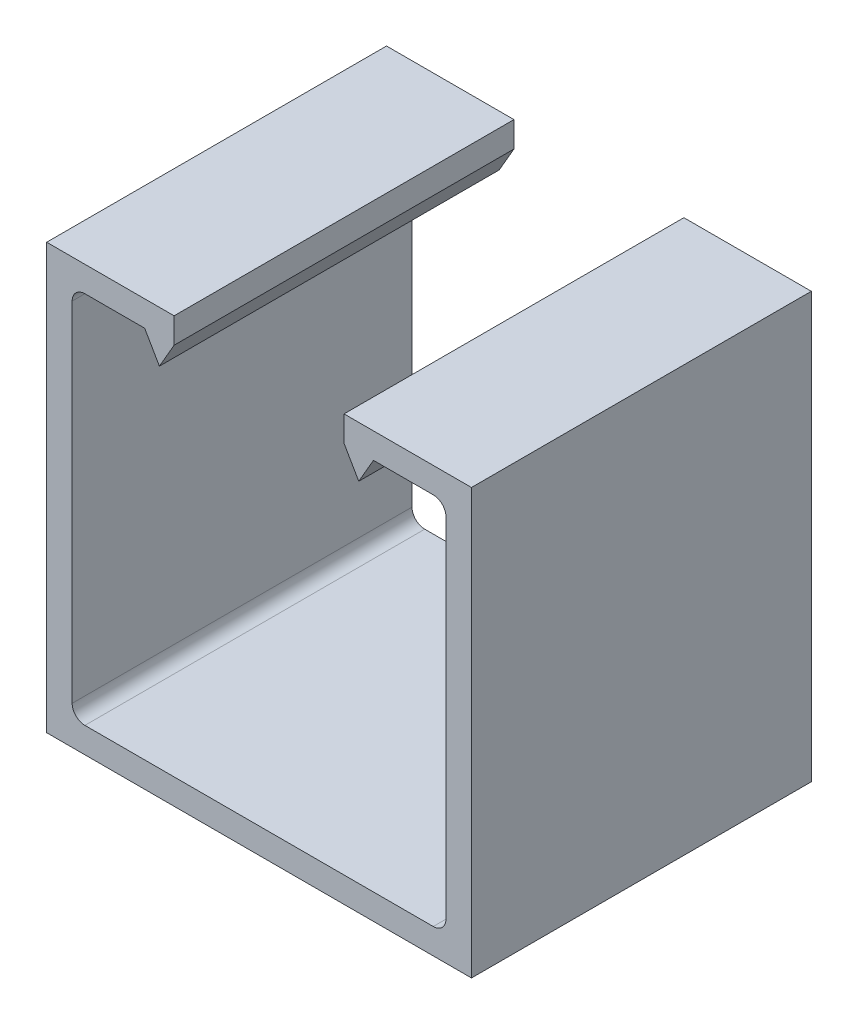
ISO-10303-21;
HEADER;
FILE_DESCRIPTION(('STEP AP214'),'2;1');
FILE_NAME('part.step','',(''),(''),'','','');
FILE_SCHEMA(('AUTOMOTIVE_DESIGN { 1 0 10303 214 1 1 1 1 }'));
ENDSEC;
DATA;
#1=APPLICATION_CONTEXT('core data for automotive mechanical design processes');
#2=APPLICATION_PROTOCOL_DEFINITION('international standard','automotive_design',2000,#1);
#3=PRODUCT_CONTEXT('',#1,'mechanical');
#4=PRODUCT('Part','Part','',(#3));
#5=PRODUCT_RELATED_PRODUCT_CATEGORY('part','',(#4));
#6=PRODUCT_DEFINITION_FORMATION('','',#4);
#7=PRODUCT_DEFINITION_CONTEXT('part definition',#1,'design');
#8=PRODUCT_DEFINITION('design','',#6,#7);
#9=PRODUCT_DEFINITION_SHAPE('','',#8);
#10=(LENGTH_UNIT() NAMED_UNIT(*) SI_UNIT(.MILLI.,.METRE.));
#11=(NAMED_UNIT(*) PLANE_ANGLE_UNIT() SI_UNIT($,.RADIAN.));
#12=(NAMED_UNIT(*) SI_UNIT($,.STERADIAN.) SOLID_ANGLE_UNIT());
#13=UNCERTAINTY_MEASURE_WITH_UNIT(LENGTH_MEASURE(1.E-05),#10,'distance_accuracy_value','');
#14=(GEOMETRIC_REPRESENTATION_CONTEXT(3) GLOBAL_UNCERTAINTY_ASSIGNED_CONTEXT((#13)) GLOBAL_UNIT_ASSIGNED_CONTEXT((#10,
#11,#12)) REPRESENTATION_CONTEXT('',''));
#15=CARTESIAN_POINT('',(0.,0.,0.));
#16=DIRECTION('',(0.,0.,1.));
#17=DIRECTION('',(1.,0.,0.));
#18=AXIS2_PLACEMENT_3D('',#15,#16,#17);
#19=CARTESIAN_POINT('',(-13.0175,-13.0175,12.7));
#20=DIRECTION('',(0.,0.,-1.));
#21=DIRECTION('',(-1.,0.,0.));
#22=AXIS2_PLACEMENT_3D('',#19,#20,#21);
#23=CYLINDRICAL_SURFACE('',#22,0.952500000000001);
#24=CARTESIAN_POINT('',(-13.0175,-13.0175,-12.7));
#25=DIRECTION('',(0.,0.,-1.));
#26=DIRECTION('',(1.,0.,0.));
#27=AXIS2_PLACEMENT_3D('',#24,#25,#26);
#28=CIRCLE('',#27,0.952500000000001);
#29=CARTESIAN_POINT('',(-13.0175,-13.97,-12.7));
#30=VERTEX_POINT('',#29);
#31=CARTESIAN_POINT('',(-13.97,-13.0175,-12.7));
#32=VERTEX_POINT('',#31);
#33=EDGE_CURVE('E200',#30,#32,#28,.T.);
#34=ORIENTED_EDGE('',*,*,#33,.T.);
#35=DIRECTION('',(0.,0.,-1.));
#36=VECTOR('',#35,1.);
#37=CARTESIAN_POINT('',(-13.97,-13.0175,12.7));
#38=LINE('',#37,#36);
#39=CARTESIAN_POINT('',(-13.97,-13.0175,12.7));
#40=VERTEX_POINT('',#39);
#41=EDGE_CURVE('E11',#40,#32,#38,.T.);
#42=ORIENTED_EDGE('',*,*,#41,.F.);
#43=CARTESIAN_POINT('',(-13.0175,-13.0175,12.7));
#44=DIRECTION('',(0.,0.,-1.));
#45=DIRECTION('',(1.,0.,0.));
#46=AXIS2_PLACEMENT_3D('',#43,#44,#45);
#47=CIRCLE('',#46,0.952500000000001);
#48=CARTESIAN_POINT('',(-13.0175,-13.97,12.7));
#49=VERTEX_POINT('',#48);
#50=EDGE_CURVE('E238',#49,#40,#47,.T.);
#51=ORIENTED_EDGE('',*,*,#50,.F.);
#52=DIRECTION('',(0.,0.,-1.));
#53=VECTOR('',#52,1.);
#54=CARTESIAN_POINT('',(-13.0175,-13.97,12.7));
#55=LINE('',#54,#53);
#56=EDGE_CURVE('E196',#49,#30,#55,.T.);
#57=ORIENTED_EDGE('',*,*,#56,.T.);
#58=EDGE_LOOP('',(#34,#42,#51,#57));
#59=FACE_BOUND('',#58,.T.);
#60=ADVANCED_FACE('F32',(#59),#23,.F.);
#61=CARTESIAN_POINT('',(-13.97,13.0175,12.7));
#62=DIRECTION('',(-1.,0.,0.));
#63=DIRECTION('',(0.,-1.,0.));
#64=AXIS2_PLACEMENT_3D('',#61,#62,#63);
#65=PLANE('',#64);
#66=DIRECTION('',(0.,1.,0.));
#67=VECTOR('',#66,1.);
#68=CARTESIAN_POINT('',(-13.97,13.0175,-12.7));
#69=LINE('',#68,#67);
#70=CARTESIAN_POINT('',(-13.97,13.0175,-12.7));
#71=VERTEX_POINT('',#70);
#72=EDGE_CURVE('E203',#32,#71,#69,.T.);
#73=ORIENTED_EDGE('',*,*,#72,.T.);
#74=DIRECTION('',(0.,0.,-1.));
#75=VECTOR('',#74,1.);
#76=CARTESIAN_POINT('',(-13.97,13.0175,12.7));
#77=LINE('',#76,#75);
#78=CARTESIAN_POINT('',(-13.97,13.0175,12.7));
#79=VERTEX_POINT('',#78);
#80=EDGE_CURVE('E40',#79,#71,#77,.T.);
#81=ORIENTED_EDGE('',*,*,#80,.F.);
#82=DIRECTION('',(0.,1.,0.));
#83=VECTOR('',#82,1.);
#84=CARTESIAN_POINT('',(-13.97,13.0175,12.7));
#85=LINE('',#84,#83);
#86=EDGE_CURVE('E127',#40,#79,#85,.T.);
#87=ORIENTED_EDGE('',*,*,#86,.F.);
#88=ORIENTED_EDGE('',*,*,#41,.T.);
#89=EDGE_LOOP('',(#73,#81,#87,#88));
#90=FACE_BOUND('',#89,.T.);
#91=ADVANCED_FACE('F356',(#90),#65,.F.);
#92=CARTESIAN_POINT('',(-13.0175,13.0175,12.7));
#93=DIRECTION('',(0.,0.,-1.));
#94=DIRECTION('',(-1.,0.,0.));
#95=AXIS2_PLACEMENT_3D('',#92,#93,#94);
#96=CYLINDRICAL_SURFACE('',#95,0.952500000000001);
#97=CARTESIAN_POINT('',(-13.0175,13.0175,-12.7));
#98=DIRECTION('',(0.,0.,-1.));
#99=DIRECTION('',(1.,0.,0.));
#100=AXIS2_PLACEMENT_3D('',#97,#98,#99);
#101=CIRCLE('',#100,0.952500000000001);
#102=CARTESIAN_POINT('',(-13.0175,13.97,-12.7));
#103=VERTEX_POINT('',#102);
#104=EDGE_CURVE('E205',#71,#103,#101,.T.);
#105=ORIENTED_EDGE('',*,*,#104,.T.);
#106=DIRECTION('',(0.,0.,-1.));
#107=VECTOR('',#106,1.);
#108=CARTESIAN_POINT('',(-13.0175,13.97,12.7));
#109=LINE('',#108,#107);
#110=CARTESIAN_POINT('',(-13.0175,13.97,12.7));
#111=VERTEX_POINT('',#110);
#112=EDGE_CURVE('E281',#111,#103,#109,.T.);
#113=ORIENTED_EDGE('',*,*,#112,.F.);
#114=CARTESIAN_POINT('',(-13.0175,13.0175,12.7));
#115=DIRECTION('',(0.,0.,-1.));
#116=DIRECTION('',(1.,0.,0.));
#117=AXIS2_PLACEMENT_3D('',#114,#115,#116);
#118=CIRCLE('',#117,0.952500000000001);
#119=EDGE_CURVE('E289',#79,#111,#118,.T.);
#120=ORIENTED_EDGE('',*,*,#119,.F.);
#121=ORIENTED_EDGE('',*,*,#80,.T.);
#122=EDGE_LOOP('',(#105,#113,#120,#121));
#123=FACE_BOUND('',#122,.T.);
#124=ADVANCED_FACE('F287',(#123),#96,.F.);
#125=CARTESIAN_POINT('',(-8.54970452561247,13.97,12.7));
#126=DIRECTION('',(0.,1.,0.));
#127=DIRECTION('',(0.,0.,1.));
#128=AXIS2_PLACEMENT_3D('',#125,#126,#127);
#129=PLANE('',#128);
#130=DIRECTION('',(1.,0.,0.));
#131=VECTOR('',#130,1.);
#132=CARTESIAN_POINT('',(-8.54970452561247,13.97,-12.7));
#133=LINE('',#132,#131);
#134=CARTESIAN_POINT('',(-8.54970452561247,13.97,-12.7));
#135=VERTEX_POINT('',#134);
#136=EDGE_CURVE('E207',#103,#135,#133,.T.);
#137=ORIENTED_EDGE('',*,*,#136,.T.);
#138=DIRECTION('',(0.,0.,-1.));
#139=VECTOR('',#138,1.);
#140=CARTESIAN_POINT('',(-8.54970452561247,13.97,12.7));
#141=LINE('',#140,#139);
#142=CARTESIAN_POINT('',(-8.54970452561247,13.97,12.7));
#143=VERTEX_POINT('',#142);
#144=EDGE_CURVE('E278',#143,#135,#141,.T.);
#145=ORIENTED_EDGE('',*,*,#144,.F.);
#146=DIRECTION('',(1.,0.,0.));
#147=VECTOR('',#146,1.);
#148=CARTESIAN_POINT('',(-8.54970452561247,13.97,12.7));
#149=LINE('',#148,#147);
#150=EDGE_CURVE('E307',#111,#143,#149,.T.);
#151=ORIENTED_EDGE('',*,*,#150,.F.);
#152=ORIENTED_EDGE('',*,*,#112,.T.);
#153=EDGE_LOOP('',(#137,#145,#151,#152));
#154=FACE_BOUND('',#153,.T.);
#155=ADVANCED_FACE('F298',(#154),#129,.F.);
#156=CARTESIAN_POINT('',(-8.54970452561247,13.97,12.7));
#157=DIRECTION('',(0.86602540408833,0.499999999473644,0.));
#158=DIRECTION('',(-0.499999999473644,0.866025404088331,0.));
#159=AXIS2_PLACEMENT_3D('',#156,#157,#158);
#160=PLANE('',#159);
#161=DIRECTION('',(0.499999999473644,-0.866025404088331,0.));
#162=VECTOR('',#161,1.);
#163=CARTESIAN_POINT('',(-8.54970452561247,13.97,-12.7));
#164=LINE('',#163,#162);
#165=CARTESIAN_POINT('',(-7.44985226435,12.065,-12.7));
#166=VERTEX_POINT('',#165);
#167=EDGE_CURVE('E209',#135,#166,#164,.T.);
#168=ORIENTED_EDGE('',*,*,#167,.T.);
#169=DIRECTION('',(0.,0.,-1.));
#170=VECTOR('',#169,1.);
#171=CARTESIAN_POINT('',(-7.44985226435,12.065,12.7));
#172=LINE('',#171,#170);
#173=CARTESIAN_POINT('',(-7.44985226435,12.065,12.7));
#174=VERTEX_POINT('',#173);
#175=EDGE_CURVE('E275',#174,#166,#172,.T.);
#176=ORIENTED_EDGE('',*,*,#175,.F.);
#177=DIRECTION('',(0.499999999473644,-0.866025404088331,0.));
#178=VECTOR('',#177,1.);
#179=CARTESIAN_POINT('',(-8.54970452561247,13.97,12.7));
#180=LINE('',#179,#178);
#181=EDGE_CURVE('E304',#143,#174,#180,.T.);
#182=ORIENTED_EDGE('',*,*,#181,.F.);
#183=ORIENTED_EDGE('',*,*,#144,.T.);
#184=EDGE_LOOP('',(#168,#176,#182,#183));
#185=FACE_BOUND('',#184,.T.);
#186=ADVANCED_FACE('F302',(#185),#160,.F.);
#187=CARTESIAN_POINT('',(-7.44985226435,12.065,12.7));
#188=DIRECTION('',(-0.866025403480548,0.500000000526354,0.));
#189=DIRECTION('',(-0.500000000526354,-0.866025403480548,0.));
#190=AXIS2_PLACEMENT_3D('',#187,#188,#189);
#191=PLANE('',#190);
#192=DIRECTION('',(0.500000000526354,0.866025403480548,0.));
#193=VECTOR('',#192,1.);
#194=CARTESIAN_POINT('',(-7.44985226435,12.065,-12.7));
#195=LINE('',#194,#193);
#196=CARTESIAN_POINT('',(-6.35,13.97,-12.7));
#197=VERTEX_POINT('',#196);
#198=EDGE_CURVE('E211',#166,#197,#195,.T.);
#199=ORIENTED_EDGE('',*,*,#198,.T.);
#200=DIRECTION('',(0.,0.,-1.));
#201=VECTOR('',#200,1.);
#202=CARTESIAN_POINT('',(-6.35,13.97,12.7));
#203=LINE('',#202,#201);
#204=CARTESIAN_POINT('',(-6.35,13.97,12.7));
#205=VERTEX_POINT('',#204);
#206=EDGE_CURVE('E272',#205,#197,#203,.T.);
#207=ORIENTED_EDGE('',*,*,#206,.F.);
#208=DIRECTION('',(0.500000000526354,0.866025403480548,0.));
#209=VECTOR('',#208,1.);
#210=CARTESIAN_POINT('',(-7.44985226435,12.065,12.7));
#211=LINE('',#210,#209);
#212=EDGE_CURVE('E306',#174,#205,#211,.T.);
#213=ORIENTED_EDGE('',*,*,#212,.F.);
#214=ORIENTED_EDGE('',*,*,#175,.T.);
#215=EDGE_LOOP('',(#199,#207,#213,#214));
#216=FACE_BOUND('',#215,.T.);
#217=ADVANCED_FACE('F369',(#216),#191,.F.);
#218=CARTESIAN_POINT('',(-6.35,13.97,12.7));
#219=DIRECTION('',(-1.,0.,0.));
#220=DIRECTION('',(0.,-1.,0.));
#221=AXIS2_PLACEMENT_3D('',#218,#219,#220);
#222=PLANE('',#221);
#223=DIRECTION('',(0.,1.,0.));
#224=VECTOR('',#223,1.);
#225=CARTESIAN_POINT('',(-6.35,13.97,-12.7));
#226=LINE('',#225,#224);
#227=CARTESIAN_POINT('',(-6.35,15.875,-12.7));
#228=VERTEX_POINT('',#227);
#229=EDGE_CURVE('E213',#197,#228,#226,.T.);
#230=ORIENTED_EDGE('',*,*,#229,.T.);
#231=DIRECTION('',(0.,0.,-1.));
#232=VECTOR('',#231,1.);
#233=CARTESIAN_POINT('',(-6.35,15.875,12.7));
#234=LINE('',#233,#232);
#235=CARTESIAN_POINT('',(-6.35,15.875,12.7));
#236=VERTEX_POINT('',#235);
#237=EDGE_CURVE('E269',#236,#228,#234,.T.);
#238=ORIENTED_EDGE('',*,*,#237,.F.);
#239=DIRECTION('',(0.,1.,0.));
#240=VECTOR('',#239,1.);
#241=CARTESIAN_POINT('',(-6.35,13.97,12.7));
#242=LINE('',#241,#240);
#243=EDGE_CURVE('E309',#205,#236,#242,.T.);
#244=ORIENTED_EDGE('',*,*,#243,.F.);
#245=ORIENTED_EDGE('',*,*,#206,.T.);
#246=EDGE_LOOP('',(#230,#238,#244,#245));
#247=FACE_BOUND('',#246,.T.);
#248=ADVANCED_FACE('F372',(#247),#222,.F.);
#249=CARTESIAN_POINT('',(-6.35,15.875,12.7));
#250=DIRECTION('',(0.,-1.,0.));
#251=DIRECTION('',(0.,0.,-1.));
#252=AXIS2_PLACEMENT_3D('',#249,#250,#251);
#253=PLANE('',#252);
#254=DIRECTION('',(-1.,0.,0.));
#255=VECTOR('',#254,1.);
#256=CARTESIAN_POINT('',(-6.35,15.875,-12.7));
#257=LINE('',#256,#255);
#258=CARTESIAN_POINT('',(-15.875,15.875,-12.7));
#259=VERTEX_POINT('',#258);
#260=EDGE_CURVE('E215',#228,#259,#257,.T.);
#261=ORIENTED_EDGE('',*,*,#260,.T.);
#262=DIRECTION('',(0.,0.,-1.));
#263=VECTOR('',#262,1.);
#264=CARTESIAN_POINT('',(-15.875,15.875,12.7));
#265=LINE('',#264,#263);
#266=CARTESIAN_POINT('',(-15.875,15.875,12.7));
#267=VERTEX_POINT('',#266);
#268=EDGE_CURVE('E266',#267,#259,#265,.T.);
#269=ORIENTED_EDGE('',*,*,#268,.F.);
#270=DIRECTION('',(-1.,0.,0.));
#271=VECTOR('',#270,1.);
#272=CARTESIAN_POINT('',(-6.35,15.875,12.7));
#273=LINE('',#272,#271);
#274=EDGE_CURVE('E315',#236,#267,#273,.T.);
#275=ORIENTED_EDGE('',*,*,#274,.F.);
#276=ORIENTED_EDGE('',*,*,#237,.T.);
#277=EDGE_LOOP('',(#261,#269,#275,#276));
#278=FACE_BOUND('',#277,.T.);
#279=ADVANCED_FACE('F376',(#278),#253,.F.);
#280=CARTESIAN_POINT('',(-15.875,15.875,12.7));
#281=DIRECTION('',(1.,0.,0.));
#282=DIRECTION('',(0.,1.,0.));
#283=AXIS2_PLACEMENT_3D('',#280,#281,#282);
#284=PLANE('',#283);
#285=DIRECTION('',(0.,-1.,0.));
#286=VECTOR('',#285,1.);
#287=CARTESIAN_POINT('',(-15.875,15.875,-12.7));
#288=LINE('',#287,#286);
#289=CARTESIAN_POINT('',(-15.875,-15.875,-12.7));
#290=VERTEX_POINT('',#289);
#291=EDGE_CURVE('E217',#259,#290,#288,.T.);
#292=ORIENTED_EDGE('',*,*,#291,.T.);
#293=DIRECTION('',(0.,0.,-1.));
#294=VECTOR('',#293,1.);
#295=CARTESIAN_POINT('',(-15.875,-15.875,12.7));
#296=LINE('',#295,#294);
#297=CARTESIAN_POINT('',(-15.875,-15.875,12.7));
#298=VERTEX_POINT('',#297);
#299=EDGE_CURVE('E263',#298,#290,#296,.T.);
#300=ORIENTED_EDGE('',*,*,#299,.F.);
#301=DIRECTION('',(0.,-1.,0.));
#302=VECTOR('',#301,1.);
#303=CARTESIAN_POINT('',(-15.875,15.875,12.7));
#304=LINE('',#303,#302);
#305=EDGE_CURVE('E317',#267,#298,#304,.T.);
#306=ORIENTED_EDGE('',*,*,#305,.F.);
#307=ORIENTED_EDGE('',*,*,#268,.T.);
#308=EDGE_LOOP('',(#292,#300,#306,#307));
#309=FACE_BOUND('',#308,.T.);
#310=ADVANCED_FACE('F380',(#309),#284,.F.);
#311=CARTESIAN_POINT('',(-15.875,-15.875,12.7));
#312=DIRECTION('',(0.,1.,0.));
#313=DIRECTION('',(-1.,0.,0.));
#314=AXIS2_PLACEMENT_3D('',#311,#312,#313);
#315=PLANE('',#314);
#316=DIRECTION('',(1.,0.,0.));
#317=VECTOR('',#316,1.);
#318=CARTESIAN_POINT('',(-15.875,-15.875,-12.7));
#319=LINE('',#318,#317);
#320=CARTESIAN_POINT('',(15.875,-15.875,-12.7));
#321=VERTEX_POINT('',#320);
#322=EDGE_CURVE('E219',#290,#321,#319,.T.);
#323=ORIENTED_EDGE('',*,*,#322,.T.);
#324=DIRECTION('',(0.,0.,-1.));
#325=VECTOR('',#324,1.);
#326=CARTESIAN_POINT('',(15.875,-15.875,12.7));
#327=LINE('',#326,#325);
#328=CARTESIAN_POINT('',(15.875,-15.875,12.7));
#329=VERTEX_POINT('',#328);
#330=EDGE_CURVE('E260',#329,#321,#327,.T.);
#331=ORIENTED_EDGE('',*,*,#330,.F.);
#332=DIRECTION('',(1.,0.,0.));
#333=VECTOR('',#332,1.);
#334=CARTESIAN_POINT('',(-15.875,-15.875,12.7));
#335=LINE('',#334,#333);
#336=EDGE_CURVE('E319',#298,#329,#335,.T.);
#337=ORIENTED_EDGE('',*,*,#336,.F.);
#338=ORIENTED_EDGE('',*,*,#299,.T.);
#339=EDGE_LOOP('',(#323,#331,#337,#338));
#340=FACE_BOUND('',#339,.T.);
#341=ADVANCED_FACE('F384',(#340),#315,.F.);
#342=CARTESIAN_POINT('',(15.875,-15.875,12.7));
#343=DIRECTION('',(-1.,0.,0.));
#344=DIRECTION('',(0.,0.,1.));
#345=AXIS2_PLACEMENT_3D('',#342,#343,#344);
#346=PLANE('',#345);
#347=DIRECTION('',(0.,1.,0.));
#348=VECTOR('',#347,1.);
#349=CARTESIAN_POINT('',(15.875,-15.875,-12.7));
#350=LINE('',#349,#348);
#351=CARTESIAN_POINT('',(15.875,15.875,-12.7));
#352=VERTEX_POINT('',#351);
#353=EDGE_CURVE('E221',#321,#352,#350,.T.);
#354=ORIENTED_EDGE('',*,*,#353,.T.);
#355=DIRECTION('',(0.,0.,-1.));
#356=VECTOR('',#355,1.);
#357=CARTESIAN_POINT('',(15.875,15.875,12.7));
#358=LINE('',#357,#356);
#359=CARTESIAN_POINT('',(15.875,15.875,12.7));
#360=VERTEX_POINT('',#359);
#361=EDGE_CURVE('E257',#360,#352,#358,.T.);
#362=ORIENTED_EDGE('',*,*,#361,.F.);
#363=DIRECTION('',(0.,1.,0.));
#364=VECTOR('',#363,1.);
#365=CARTESIAN_POINT('',(15.875,-15.875,12.7));
#366=LINE('',#365,#364);
#367=EDGE_CURVE('E321',#329,#360,#366,.T.);
#368=ORIENTED_EDGE('',*,*,#367,.F.);
#369=ORIENTED_EDGE('',*,*,#330,.T.);
#370=EDGE_LOOP('',(#354,#362,#368,#369));
#371=FACE_BOUND('',#370,.T.);
#372=ADVANCED_FACE('F388',(#371),#346,.F.);
#373=CARTESIAN_POINT('',(15.875,15.875,12.7));
#374=DIRECTION('',(0.,-1.,0.));
#375=DIRECTION('',(1.,0.,0.));
#376=AXIS2_PLACEMENT_3D('',#373,#374,#375);
#377=PLANE('',#376);
#378=DIRECTION('',(-1.,0.,0.));
#379=VECTOR('',#378,1.);
#380=CARTESIAN_POINT('',(15.875,15.875,-12.7));
#381=LINE('',#380,#379);
#382=CARTESIAN_POINT('',(6.34999999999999,15.875,-12.7));
#383=VERTEX_POINT('',#382);
#384=EDGE_CURVE('E223',#352,#383,#381,.T.);
#385=ORIENTED_EDGE('',*,*,#384,.T.);
#386=DIRECTION('',(0.,0.,-1.));
#387=VECTOR('',#386,1.);
#388=CARTESIAN_POINT('',(6.34999999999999,15.875,12.7));
#389=LINE('',#388,#387);
#390=CARTESIAN_POINT('',(6.34999999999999,15.875,12.7));
#391=VERTEX_POINT('',#390);
#392=EDGE_CURVE('E254',#391,#383,#389,.T.);
#393=ORIENTED_EDGE('',*,*,#392,.F.);
#394=DIRECTION('',(-1.,0.,0.));
#395=VECTOR('',#394,1.);
#396=CARTESIAN_POINT('',(15.875,15.875,12.7));
#397=LINE('',#396,#395);
#398=EDGE_CURVE('E323',#360,#391,#397,.T.);
#399=ORIENTED_EDGE('',*,*,#398,.F.);
#400=ORIENTED_EDGE('',*,*,#361,.T.);
#401=EDGE_LOOP('',(#385,#393,#399,#400));
#402=FACE_BOUND('',#401,.T.);
#403=ADVANCED_FACE('F392',(#402),#377,.F.);
#404=CARTESIAN_POINT('',(6.34999999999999,13.97,12.7));
#405=DIRECTION('',(1.,0.,0.));
#406=DIRECTION('',(0.,0.,-1.));
#407=AXIS2_PLACEMENT_3D('',#404,#405,#406);
#408=PLANE('',#407);
#409=DIRECTION('',(0.,-1.,0.));
#410=VECTOR('',#409,1.);
#411=CARTESIAN_POINT('',(6.34999999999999,13.97,-12.7));
#412=LINE('',#411,#410);
#413=CARTESIAN_POINT('',(6.34999999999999,13.97,-12.7));
#414=VERTEX_POINT('',#413);
#415=EDGE_CURVE('E225',#383,#414,#412,.T.);
#416=ORIENTED_EDGE('',*,*,#415,.T.);
#417=DIRECTION('',(0.,0.,-1.));
#418=VECTOR('',#417,1.);
#419=CARTESIAN_POINT('',(6.34999999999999,13.97,12.7));
#420=LINE('',#419,#418);
#421=CARTESIAN_POINT('',(6.34999999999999,13.97,12.7));
#422=VERTEX_POINT('',#421);
#423=EDGE_CURVE('E251',#422,#414,#420,.T.);
#424=ORIENTED_EDGE('',*,*,#423,.F.);
#425=DIRECTION('',(0.,-1.,0.));
#426=VECTOR('',#425,1.);
#427=CARTESIAN_POINT('',(6.34999999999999,13.97,12.7));
#428=LINE('',#427,#426);
#429=EDGE_CURVE('E325',#391,#422,#428,.T.);
#430=ORIENTED_EDGE('',*,*,#429,.F.);
#431=ORIENTED_EDGE('',*,*,#392,.T.);
#432=EDGE_LOOP('',(#416,#424,#430,#431));
#433=FACE_BOUND('',#432,.T.);
#434=ADVANCED_FACE('F396',(#433),#408,.F.);
#435=CARTESIAN_POINT('',(7.44985226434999,12.065,12.7));
#436=DIRECTION('',(0.866025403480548,0.500000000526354,0.));
#437=DIRECTION('',(-0.500000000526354,0.866025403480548,0.));
#438=AXIS2_PLACEMENT_3D('',#435,#436,#437);
#439=PLANE('',#438);
#440=DIRECTION('',(0.500000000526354,-0.866025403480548,0.));
#441=VECTOR('',#440,1.);
#442=CARTESIAN_POINT('',(7.44985226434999,12.065,-12.7));
#443=LINE('',#442,#441);
#444=CARTESIAN_POINT('',(7.44985226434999,12.065,-12.7));
#445=VERTEX_POINT('',#444);
#446=EDGE_CURVE('E227',#414,#445,#443,.T.);
#447=ORIENTED_EDGE('',*,*,#446,.T.);
#448=DIRECTION('',(0.,0.,-1.));
#449=VECTOR('',#448,1.);
#450=CARTESIAN_POINT('',(7.44985226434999,12.065,12.7));
#451=LINE('',#450,#449);
#452=CARTESIAN_POINT('',(7.44985226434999,12.065,12.7));
#453=VERTEX_POINT('',#452);
#454=EDGE_CURVE('E248',#453,#445,#451,.T.);
#455=ORIENTED_EDGE('',*,*,#454,.F.);
#456=DIRECTION('',(0.500000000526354,-0.866025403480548,0.));
#457=VECTOR('',#456,1.);
#458=CARTESIAN_POINT('',(7.44985226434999,12.065,12.7));
#459=LINE('',#458,#457);
#460=EDGE_CURVE('E327',#422,#453,#459,.T.);
#461=ORIENTED_EDGE('',*,*,#460,.F.);
#462=ORIENTED_EDGE('',*,*,#423,.T.);
#463=EDGE_LOOP('',(#447,#455,#461,#462));
#464=FACE_BOUND('',#463,.T.);
#465=ADVANCED_FACE('F400',(#464),#439,.F.);
#466=CARTESIAN_POINT('',(8.54970452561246,13.97,12.7));
#467=DIRECTION('',(-0.866025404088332,0.499999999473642,0.));
#468=DIRECTION('',(-0.499999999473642,-0.866025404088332,0.));
#469=AXIS2_PLACEMENT_3D('',#466,#467,#468);
#470=PLANE('',#469);
#471=DIRECTION('',(0.499999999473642,0.866025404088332,0.));
#472=VECTOR('',#471,1.);
#473=CARTESIAN_POINT('',(8.54970452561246,13.97,-12.7));
#474=LINE('',#473,#472);
#475=CARTESIAN_POINT('',(8.54970452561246,13.97,-12.7));
#476=VERTEX_POINT('',#475);
#477=EDGE_CURVE('E229',#445,#476,#474,.T.);
#478=ORIENTED_EDGE('',*,*,#477,.T.);
#479=DIRECTION('',(0.,0.,-1.));
#480=VECTOR('',#479,1.);
#481=CARTESIAN_POINT('',(8.54970452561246,13.97,12.7));
#482=LINE('',#481,#480);
#483=CARTESIAN_POINT('',(8.54970452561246,13.97,12.7));
#484=VERTEX_POINT('',#483);
#485=EDGE_CURVE('E245',#484,#476,#482,.T.);
#486=ORIENTED_EDGE('',*,*,#485,.F.);
#487=DIRECTION('',(0.499999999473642,0.866025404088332,0.));
#488=VECTOR('',#487,1.);
#489=CARTESIAN_POINT('',(8.54970452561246,13.97,12.7));
#490=LINE('',#489,#488);
#491=EDGE_CURVE('E329',#453,#484,#490,.T.);
#492=ORIENTED_EDGE('',*,*,#491,.F.);
#493=ORIENTED_EDGE('',*,*,#454,.T.);
#494=EDGE_LOOP('',(#478,#486,#492,#493));
#495=FACE_BOUND('',#494,.T.);
#496=ADVANCED_FACE('F404',(#495),#470,.F.);
#497=CARTESIAN_POINT('',(13.0175,13.97,12.7));
#498=DIRECTION('',(0.,1.,0.));
#499=DIRECTION('',(-1.,0.,0.));
#500=AXIS2_PLACEMENT_3D('',#497,#498,#499);
#501=PLANE('',#500);
#502=DIRECTION('',(1.,0.,0.));
#503=VECTOR('',#502,1.);
#504=CARTESIAN_POINT('',(13.0175,13.97,-12.7));
#505=LINE('',#504,#503);
#506=CARTESIAN_POINT('',(13.0175,13.97,-12.7));
#507=VERTEX_POINT('',#506);
#508=EDGE_CURVE('E231',#476,#507,#505,.T.);
#509=ORIENTED_EDGE('',*,*,#508,.T.);
#510=DIRECTION('',(0.,0.,-1.));
#511=VECTOR('',#510,1.);
#512=CARTESIAN_POINT('',(13.0175,13.97,12.7));
#513=LINE('',#512,#511);
#514=CARTESIAN_POINT('',(13.0175,13.97,12.7));
#515=VERTEX_POINT('',#514);
#516=EDGE_CURVE('E242',#515,#507,#513,.T.);
#517=ORIENTED_EDGE('',*,*,#516,.F.);
#518=DIRECTION('',(1.,0.,0.));
#519=VECTOR('',#518,1.);
#520=CARTESIAN_POINT('',(13.0175,13.97,12.7));
#521=LINE('',#520,#519);
#522=EDGE_CURVE('E331',#484,#515,#521,.T.);
#523=ORIENTED_EDGE('',*,*,#522,.F.);
#524=ORIENTED_EDGE('',*,*,#485,.T.);
#525=EDGE_LOOP('',(#509,#517,#523,#524));
#526=FACE_BOUND('',#525,.T.);
#527=ADVANCED_FACE('F337',(#526),#501,.F.);
#528=CARTESIAN_POINT('',(13.0175,13.0175,12.7));
#529=DIRECTION('',(0.,0.,-1.));
#530=DIRECTION('',(-1.,0.,0.));
#531=AXIS2_PLACEMENT_3D('',#528,#529,#530);
#532=CYLINDRICAL_SURFACE('',#531,0.952500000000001);
#533=CARTESIAN_POINT('',(13.0175,13.0175,-12.7));
#534=DIRECTION('',(0.,0.,-1.));
#535=DIRECTION('',(1.,0.,0.));
#536=AXIS2_PLACEMENT_3D('',#533,#534,#535);
#537=CIRCLE('',#536,0.952500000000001);
#538=CARTESIAN_POINT('',(13.97,13.0175,-12.7));
#539=VERTEX_POINT('',#538);
#540=EDGE_CURVE('E233',#507,#539,#537,.T.);
#541=ORIENTED_EDGE('',*,*,#540,.T.);
#542=DIRECTION('',(0.,0.,-1.));
#543=VECTOR('',#542,1.);
#544=CARTESIAN_POINT('',(13.97,13.0175,12.7));
#545=LINE('',#544,#543);
#546=CARTESIAN_POINT('',(13.97,13.0175,12.7));
#547=VERTEX_POINT('',#546);
#548=EDGE_CURVE('E191',#547,#539,#545,.T.);
#549=ORIENTED_EDGE('',*,*,#548,.F.);
#550=CARTESIAN_POINT('',(13.0175,13.0175,12.7));
#551=DIRECTION('',(0.,0.,-1.));
#552=DIRECTION('',(1.,0.,0.));
#553=AXIS2_PLACEMENT_3D('',#550,#551,#552);
#554=CIRCLE('',#553,0.952500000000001);
#555=EDGE_CURVE('E182',#515,#547,#554,.T.);
#556=ORIENTED_EDGE('',*,*,#555,.F.);
#557=ORIENTED_EDGE('',*,*,#516,.T.);
#558=EDGE_LOOP('',(#541,#549,#556,#557));
#559=FACE_BOUND('',#558,.T.);
#560=ADVANCED_FACE('F341',(#559),#532,.F.);
#561=CARTESIAN_POINT('',(13.97,-13.0175,12.7));
#562=DIRECTION('',(1.,0.,0.));
#563=DIRECTION('',(0.,0.,-1.));
#564=AXIS2_PLACEMENT_3D('',#561,#562,#563);
#565=PLANE('',#564);
#566=DIRECTION('',(0.,-1.,0.));
#567=VECTOR('',#566,1.);
#568=CARTESIAN_POINT('',(13.97,-13.0175,-12.7));
#569=LINE('',#568,#567);
#570=CARTESIAN_POINT('',(13.97,-13.0175,-12.7));
#571=VERTEX_POINT('',#570);
#572=EDGE_CURVE('E190',#539,#571,#569,.T.);
#573=ORIENTED_EDGE('',*,*,#572,.T.);
#574=DIRECTION('',(0.,0.,-1.));
#575=VECTOR('',#574,1.);
#576=CARTESIAN_POINT('',(13.97,-13.0175,12.7));
#577=LINE('',#576,#575);
#578=CARTESIAN_POINT('',(13.97,-13.0175,12.7));
#579=VERTEX_POINT('',#578);
#580=EDGE_CURVE('E187',#579,#571,#577,.T.);
#581=ORIENTED_EDGE('',*,*,#580,.F.);
#582=DIRECTION('',(0.,-1.,0.));
#583=VECTOR('',#582,1.);
#584=CARTESIAN_POINT('',(13.97,-13.0175,12.7));
#585=LINE('',#584,#583);
#586=EDGE_CURVE('E176',#547,#579,#585,.T.);
#587=ORIENTED_EDGE('',*,*,#586,.F.);
#588=ORIENTED_EDGE('',*,*,#548,.T.);
#589=EDGE_LOOP('',(#573,#581,#587,#588));
#590=FACE_BOUND('',#589,.T.);
#591=ADVANCED_FACE('F188',(#590),#565,.F.);
#592=CARTESIAN_POINT('',(13.0175,-13.0175,12.7));
#593=DIRECTION('',(0.,0.,-1.));
#594=DIRECTION('',(-1.,0.,0.));
#595=AXIS2_PLACEMENT_3D('',#592,#593,#594);
#596=CYLINDRICAL_SURFACE('',#595,0.952499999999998);
#597=CARTESIAN_POINT('',(13.0175,-13.0175,-12.7));
#598=DIRECTION('',(0.,0.,-1.));
#599=DIRECTION('',(1.,0.,0.));
#600=AXIS2_PLACEMENT_3D('',#597,#598,#599);
#601=CIRCLE('',#600,0.952499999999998);
#602=CARTESIAN_POINT('',(13.0175,-13.97,-12.7));
#603=VERTEX_POINT('',#602);
#604=EDGE_CURVE('E113',#571,#603,#601,.T.);
#605=ORIENTED_EDGE('',*,*,#604,.T.);
#606=DIRECTION('',(0.,0.,-1.));
#607=VECTOR('',#606,1.);
#608=CARTESIAN_POINT('',(13.0175,-13.97,12.7));
#609=LINE('',#608,#607);
#610=CARTESIAN_POINT('',(13.0175,-13.97,12.7));
#611=VERTEX_POINT('',#610);
#612=EDGE_CURVE('E192',#611,#603,#609,.T.);
#613=ORIENTED_EDGE('',*,*,#612,.F.);
#614=CARTESIAN_POINT('',(13.0175,-13.0175,12.7));
#615=DIRECTION('',(0.,0.,-1.));
#616=DIRECTION('',(1.,0.,0.));
#617=AXIS2_PLACEMENT_3D('',#614,#615,#616);
#618=CIRCLE('',#617,0.952499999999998);
#619=EDGE_CURVE('E180',#579,#611,#618,.T.);
#620=ORIENTED_EDGE('',*,*,#619,.F.);
#621=ORIENTED_EDGE('',*,*,#580,.T.);
#622=EDGE_LOOP('',(#605,#613,#620,#621));
#623=FACE_BOUND('',#622,.T.);
#624=ADVANCED_FACE('F194',(#623),#596,.F.);
#625=CARTESIAN_POINT('',(-13.0175,-13.97,12.7));
#626=DIRECTION('',(0.,-1.,0.));
#627=DIRECTION('',(1.,0.,0.));
#628=AXIS2_PLACEMENT_3D('',#625,#626,#627);
#629=PLANE('',#628);
#630=DIRECTION('',(-1.,0.,0.));
#631=VECTOR('',#630,1.);
#632=CARTESIAN_POINT('',(-13.0175,-13.97,-12.7));
#633=LINE('',#632,#631);
#634=EDGE_CURVE('E119',#603,#30,#633,.T.);
#635=ORIENTED_EDGE('',*,*,#634,.T.);
#636=ORIENTED_EDGE('',*,*,#56,.F.);
#637=DIRECTION('',(-1.,0.,0.));
#638=VECTOR('',#637,1.);
#639=CARTESIAN_POINT('',(-13.0175,-13.97,12.7));
#640=LINE('',#639,#638);
#641=EDGE_CURVE('E48',#611,#49,#640,.T.);
#642=ORIENTED_EDGE('',*,*,#641,.F.);
#643=ORIENTED_EDGE('',*,*,#612,.T.);
#644=EDGE_LOOP('',(#635,#636,#642,#643));
#645=FACE_BOUND('',#644,.T.);
#646=ADVANCED_FACE('F345',(#645),#629,.F.);
#647=CARTESIAN_POINT('',(-13.0175,-13.0175,12.7));
#648=DIRECTION('',(0.,0.,1.));
#649=DIRECTION('',(1.,0.,0.));
#650=AXIS2_PLACEMENT_3D('',#647,#648,#649);
#651=PLANE('',#650);
#652=ORIENTED_EDGE('',*,*,#50,.T.);
#653=ORIENTED_EDGE('',*,*,#86,.T.);
#654=ORIENTED_EDGE('',*,*,#119,.T.);
#655=ORIENTED_EDGE('',*,*,#150,.T.);
#656=ORIENTED_EDGE('',*,*,#181,.T.);
#657=ORIENTED_EDGE('',*,*,#212,.T.);
#658=ORIENTED_EDGE('',*,*,#243,.T.);
#659=ORIENTED_EDGE('',*,*,#274,.T.);
#660=ORIENTED_EDGE('',*,*,#305,.T.);
#661=ORIENTED_EDGE('',*,*,#336,.T.);
#662=ORIENTED_EDGE('',*,*,#367,.T.);
#663=ORIENTED_EDGE('',*,*,#398,.T.);
#664=ORIENTED_EDGE('',*,*,#429,.T.);
#665=ORIENTED_EDGE('',*,*,#460,.T.);
#666=ORIENTED_EDGE('',*,*,#491,.T.);
#667=ORIENTED_EDGE('',*,*,#522,.T.);
#668=ORIENTED_EDGE('',*,*,#555,.T.);
#669=ORIENTED_EDGE('',*,*,#586,.T.);
#670=ORIENTED_EDGE('',*,*,#619,.T.);
#671=ORIENTED_EDGE('',*,*,#641,.T.);
#672=EDGE_LOOP('',(#652,#653,#654,#655,#656,#657,#658,#659,#660,#661,#662,#663,#664,#665,#666,
#667,#668,#669,#670,#671));
#673=FACE_BOUND('',#672,.T.);
#674=ADVANCED_FACE('F178',(#673),#651,.T.);
#675=CARTESIAN_POINT('',(-13.0175,-13.0175,-12.7));
#676=DIRECTION('',(0.,0.,1.));
#677=DIRECTION('',(1.,0.,0.));
#678=AXIS2_PLACEMENT_3D('',#675,#676,#677);
#679=PLANE('',#678);
#680=ORIENTED_EDGE('',*,*,#33,.F.);
#681=ORIENTED_EDGE('',*,*,#634,.F.);
#682=ORIENTED_EDGE('',*,*,#604,.F.);
#683=ORIENTED_EDGE('',*,*,#572,.F.);
#684=ORIENTED_EDGE('',*,*,#540,.F.);
#685=ORIENTED_EDGE('',*,*,#508,.F.);
#686=ORIENTED_EDGE('',*,*,#477,.F.);
#687=ORIENTED_EDGE('',*,*,#446,.F.);
#688=ORIENTED_EDGE('',*,*,#415,.F.);
#689=ORIENTED_EDGE('',*,*,#384,.F.);
#690=ORIENTED_EDGE('',*,*,#353,.F.);
#691=ORIENTED_EDGE('',*,*,#322,.F.);
#692=ORIENTED_EDGE('',*,*,#291,.F.);
#693=ORIENTED_EDGE('',*,*,#260,.F.);
#694=ORIENTED_EDGE('',*,*,#229,.F.);
#695=ORIENTED_EDGE('',*,*,#198,.F.);
#696=ORIENTED_EDGE('',*,*,#167,.F.);
#697=ORIENTED_EDGE('',*,*,#136,.F.);
#698=ORIENTED_EDGE('',*,*,#104,.F.);
#699=ORIENTED_EDGE('',*,*,#72,.F.);
#700=EDGE_LOOP('',(#680,#681,#682,#683,#684,#685,#686,#687,#688,#689,#690,#691,#692,#693,#694,
#695,#696,#697,#698,#699));
#701=FACE_BOUND('',#700,.T.);
#702=ADVANCED_FACE('F293',(#701),#679,.F.);
#703=CLOSED_SHELL('',(#60,#91,#124,#155,#186,#217,#248,#279,#310,#341,#372,#403,#434,#465,#496,
#527,#560,#591,#624,#646,#674,#702));
#704=MANIFOLD_SOLID_BREP('B2',#703);
#705=ADVANCED_BREP_SHAPE_REPRESENTATION('',(#18,#704),#14);
#706=SHAPE_DEFINITION_REPRESENTATION(#9,#705);
ENDSEC;
END-ISO-10303-21;
